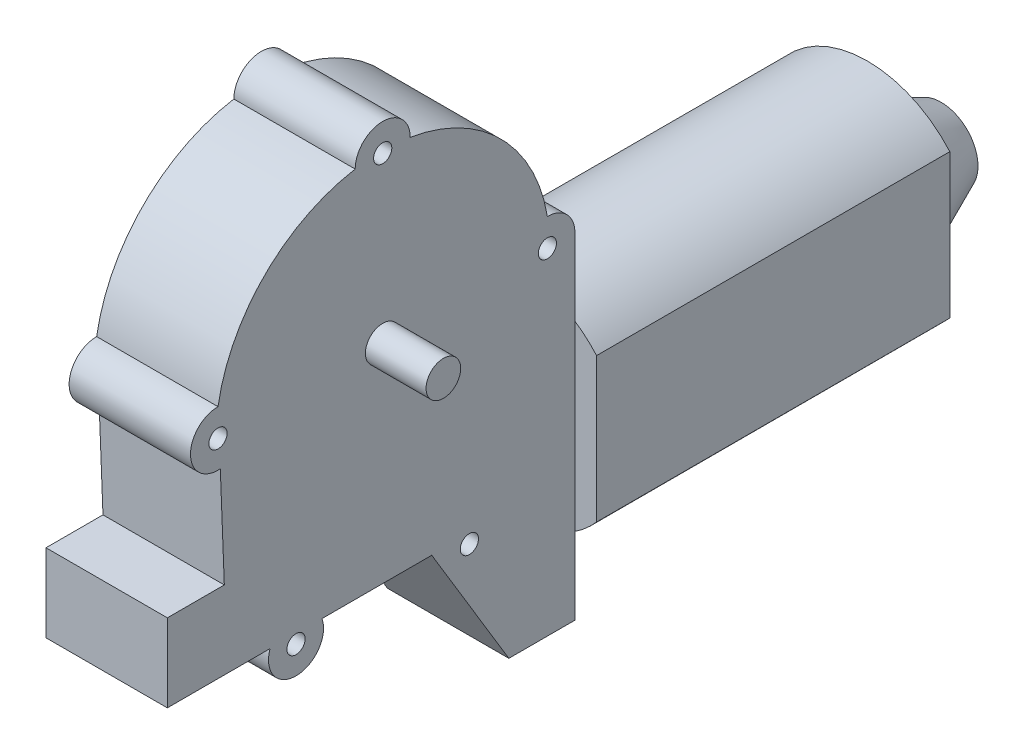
ISO-10303-21;
HEADER;
FILE_DESCRIPTION(('STEP AP214'),'2;1');
FILE_NAME('part.step','',(''),(''),'','','');
FILE_SCHEMA(('AUTOMOTIVE_DESIGN { 1 0 10303 214 1 1 1 1 }'));
ENDSEC;
DATA;
#1=APPLICATION_CONTEXT('core data for automotive mechanical design processes');
#2=APPLICATION_PROTOCOL_DEFINITION('international standard','automotive_design',2000,#1);
#3=PRODUCT_CONTEXT('',#1,'mechanical');
#4=PRODUCT('Part','Part','',(#3));
#5=PRODUCT_RELATED_PRODUCT_CATEGORY('part','',(#4));
#6=PRODUCT_DEFINITION_FORMATION('','',#4);
#7=PRODUCT_DEFINITION_CONTEXT('part definition',#1,'design');
#8=PRODUCT_DEFINITION('design','',#6,#7);
#9=PRODUCT_DEFINITION_SHAPE('','',#8);
#10=(LENGTH_UNIT() NAMED_UNIT(*) SI_UNIT(.MILLI.,.METRE.));
#11=(NAMED_UNIT(*) PLANE_ANGLE_UNIT() SI_UNIT($,.RADIAN.));
#12=(NAMED_UNIT(*) SI_UNIT($,.STERADIAN.) SOLID_ANGLE_UNIT());
#13=UNCERTAINTY_MEASURE_WITH_UNIT(LENGTH_MEASURE(1.E-05),#10,'distance_accuracy_value','');
#14=(GEOMETRIC_REPRESENTATION_CONTEXT(3) GLOBAL_UNCERTAINTY_ASSIGNED_CONTEXT((#13)) GLOBAL_UNIT_ASSIGNED_CONTEXT((#10,
#11,#12)) REPRESENTATION_CONTEXT('',''));
#15=CARTESIAN_POINT('',(0.,0.,0.));
#16=DIRECTION('',(0.,0.,1.));
#17=DIRECTION('',(1.,0.,0.));
#18=AXIS2_PLACEMENT_3D('',#15,#16,#17);
#19=CARTESIAN_POINT('',(-19.,0.,-125.85));
#20=DIRECTION('',(0.,0.,1.));
#21=DIRECTION('',(1.,0.,0.));
#22=AXIS2_PLACEMENT_3D('',#19,#20,#21);
#23=PLANE('',#22);
#24=CARTESIAN_POINT('',(0.,-38.75,-125.85));
#25=DIRECTION('',(0.,0.,-1.));
#26=DIRECTION('',(-1.,0.,0.));
#27=AXIS2_PLACEMENT_3D('',#24,#25,#26);
#28=CIRCLE('',#27,25.25);
#29=CARTESIAN_POINT('',(-19.,-22.1198316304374,-125.85));
#30=VERTEX_POINT('',#29);
#31=CARTESIAN_POINT('',(19.,-22.1198316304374,-125.85));
#32=VERTEX_POINT('',#31);
#33=EDGE_CURVE('E895',#30,#32,#28,.T.);
#34=ORIENTED_EDGE('',*,*,#33,.T.);
#35=DIRECTION('',(0.,-1.,0.));
#36=VECTOR('',#35,1.);
#37=CARTESIAN_POINT('',(19.,0.,-125.85));
#38=LINE('',#37,#36);
#39=CARTESIAN_POINT('',(19.,-55.3801683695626,-125.85));
#40=VERTEX_POINT('',#39);
#41=EDGE_CURVE('E902',#32,#40,#38,.T.);
#42=ORIENTED_EDGE('',*,*,#41,.T.);
#43=CARTESIAN_POINT('',(-19.,-55.3801683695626,-125.85));
#44=VERTEX_POINT('',#43);
#45=EDGE_CURVE('E154',#40,#44,#28,.T.);
#46=ORIENTED_EDGE('',*,*,#45,.T.);
#47=DIRECTION('',(0.,-1.,0.));
#48=VECTOR('',#47,1.);
#49=CARTESIAN_POINT('',(-19.,0.,-125.85));
#50=LINE('',#49,#48);
#51=EDGE_CURVE('E312',#30,#44,#50,.T.);
#52=ORIENTED_EDGE('',*,*,#51,.F.);
#53=EDGE_LOOP('',(#34,#42,#46,#52));
#54=FACE_BOUND('',#53,.T.);
#55=CARTESIAN_POINT('',(0.,-38.75,-125.85));
#56=DIRECTION('',(0.,0.,1.));
#57=DIRECTION('',(1.,0.,0.));
#58=AXIS2_PLACEMENT_3D('',#55,#56,#57);
#59=CIRCLE('',#58,13.85);
#60=CARTESIAN_POINT('',(13.85,-38.75,-125.85));
#61=VERTEX_POINT('',#60);
#62=EDGE_CURVE('E447',#61,#61,#59,.F.);
#63=ORIENTED_EDGE('',*,*,#62,.F.);
#64=EDGE_LOOP('',(#63));
#65=FACE_BOUND('',#64,.T.);
#66=ADVANCED_FACE('F131',(#54,#65),#23,.F.);
#67=CARTESIAN_POINT('',(-19.,0.,-44.35));
#68=DIRECTION('',(0.,0.,1.));
#69=DIRECTION('',(0.,-1.,0.));
#70=AXIS2_PLACEMENT_3D('',#67,#68,#69);
#71=PLANE('',#70);
#72=DIRECTION('',(0.,-1.,0.));
#73=VECTOR('',#72,1.);
#74=CARTESIAN_POINT('',(-14.,0.,-44.35));
#75=LINE('',#74,#73);
#76=CARTESIAN_POINT('',(-14.,-17.7366114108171,-44.35));
#77=VERTEX_POINT('',#76);
#78=CARTESIAN_POINT('',(-14.,-59.7633885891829,-44.35));
#79=VERTEX_POINT('',#78);
#80=EDGE_CURVE('E297',#77,#79,#75,.T.);
#81=ORIENTED_EDGE('',*,*,#80,.F.);
#82=CARTESIAN_POINT('',(0.,-38.75,-44.35));
#83=DIRECTION('',(0.,0.,1.));
#84=DIRECTION('',(0.,-1.,0.));
#85=AXIS2_PLACEMENT_3D('',#82,#83,#84);
#86=CIRCLE('',#85,25.25);
#87=CARTESIAN_POINT('',(-19.,-22.1198316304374,-44.35));
#88=VERTEX_POINT('',#87);
#89=EDGE_CURVE('E300',#88,#77,#86,.F.);
#90=ORIENTED_EDGE('',*,*,#89,.F.);
#91=DIRECTION('',(0.,-1.,0.));
#92=VECTOR('',#91,1.);
#93=CARTESIAN_POINT('',(-19.,0.,-44.35));
#94=LINE('',#93,#92);
#95=CARTESIAN_POINT('',(-19.,-55.3801683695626,-44.35));
#96=VERTEX_POINT('',#95);
#97=EDGE_CURVE('E299',#88,#96,#94,.T.);
#98=ORIENTED_EDGE('',*,*,#97,.T.);
#99=EDGE_CURVE('E285',#79,#96,#86,.F.);
#100=ORIENTED_EDGE('',*,*,#99,.F.);
#101=EDGE_LOOP('',(#81,#90,#98,#100));
#102=FACE_BOUND('',#101,.T.);
#103=ADVANCED_FACE('F295',(#102),#71,.T.);
#104=DIRECTION('',(0.,-1.,0.));
#105=VECTOR('',#104,1.);
#106=CARTESIAN_POINT('',(14.,0.,-44.35));
#107=LINE('',#106,#105);
#108=CARTESIAN_POINT('',(14.,-17.7366114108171,-44.35));
#109=VERTEX_POINT('',#108);
#110=CARTESIAN_POINT('',(14.,-59.7633885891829,-44.35));
#111=VERTEX_POINT('',#110);
#112=EDGE_CURVE('E328',#109,#111,#107,.T.);
#113=ORIENTED_EDGE('',*,*,#112,.T.);
#114=CARTESIAN_POINT('',(19.,-55.3801683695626,-44.35));
#115=VERTEX_POINT('',#114);
#116=EDGE_CURVE('E288',#115,#111,#86,.F.);
#117=ORIENTED_EDGE('',*,*,#116,.F.);
#118=DIRECTION('',(0.,-1.,0.));
#119=VECTOR('',#118,1.);
#120=CARTESIAN_POINT('',(19.,0.,-44.35));
#121=LINE('',#120,#119);
#122=CARTESIAN_POINT('',(19.,-22.1198316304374,-44.35));
#123=VERTEX_POINT('',#122);
#124=EDGE_CURVE('E893',#123,#115,#121,.T.);
#125=ORIENTED_EDGE('',*,*,#124,.F.);
#126=EDGE_CURVE('E146',#109,#123,#86,.F.);
#127=ORIENTED_EDGE('',*,*,#126,.F.);
#128=EDGE_LOOP('',(#113,#117,#125,#127));
#129=FACE_BOUND('',#128,.T.);
#130=ADVANCED_FACE('F471',(#129),#71,.T.);
#131=CARTESIAN_POINT('',(-19.,0.,0.));
#132=DIRECTION('',(1.,0.,0.));
#133=DIRECTION('',(0.,0.,-1.));
#134=AXIS2_PLACEMENT_3D('',#131,#132,#133);
#135=PLANE('',#134);
#136=DIRECTION('',(0.,0.,-1.));
#137=VECTOR('',#136,1.);
#138=CARTESIAN_POINT('',(-19.,-55.3801683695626,88.8692392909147));
#139=LINE('',#138,#137);
#140=EDGE_CURVE('E900',#96,#44,#139,.T.);
#141=ORIENTED_EDGE('',*,*,#140,.F.);
#142=ORIENTED_EDGE('',*,*,#97,.F.);
#143=DIRECTION('',(0.,0.,-1.));
#144=VECTOR('',#143,1.);
#145=CARTESIAN_POINT('',(-19.,-22.1198316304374,88.8692392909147));
#146=LINE('',#145,#144);
#147=EDGE_CURVE('E290',#30,#88,#146,.F.);
#148=ORIENTED_EDGE('',*,*,#147,.F.);
#149=ORIENTED_EDGE('',*,*,#51,.T.);
#150=EDGE_LOOP('',(#141,#142,#148,#149));
#151=FACE_BOUND('',#150,.T.);
#152=ADVANCED_FACE('F697',(#151),#135,.F.);
#153=CARTESIAN_POINT('',(19.,0.,0.));
#154=DIRECTION('',(1.,0.,0.));
#155=DIRECTION('',(0.,0.,-1.));
#156=AXIS2_PLACEMENT_3D('',#153,#154,#155);
#157=PLANE('',#156);
#158=ORIENTED_EDGE('',*,*,#124,.T.);
#159=DIRECTION('',(0.,0.,-1.));
#160=VECTOR('',#159,1.);
#161=CARTESIAN_POINT('',(19.,-55.3801683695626,88.8692392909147));
#162=LINE('',#161,#160);
#163=EDGE_CURVE('E445',#115,#40,#162,.T.);
#164=ORIENTED_EDGE('',*,*,#163,.T.);
#165=ORIENTED_EDGE('',*,*,#41,.F.);
#166=DIRECTION('',(0.,0.,-1.));
#167=VECTOR('',#166,1.);
#168=CARTESIAN_POINT('',(19.,-22.1198316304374,88.8692392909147));
#169=LINE('',#168,#167);
#170=EDGE_CURVE('E419',#32,#123,#169,.F.);
#171=ORIENTED_EDGE('',*,*,#170,.T.);
#172=EDGE_LOOP('',(#158,#164,#165,#171));
#173=FACE_BOUND('',#172,.T.);
#174=ADVANCED_FACE('F547',(#173),#157,.T.);
#175=CARTESIAN_POINT('',(-14.,0.,-44.35));
#176=DIRECTION('',(0.,0.,1.));
#177=DIRECTION('',(0.,-1.,0.));
#178=AXIS2_PLACEMENT_3D('',#175,#176,#177);
#179=PLANE('',#178);
#180=DIRECTION('',(0.,-1.,0.));
#181=VECTOR('',#180,1.);
#182=CARTESIAN_POINT('',(-14.,0.,-44.35));
#183=LINE('',#182,#181);
#184=CARTESIAN_POINT('',(-14.,-77.5,-44.35));
#185=VERTEX_POINT('',#184);
#186=EDGE_CURVE('E269',#79,#185,#183,.T.);
#187=ORIENTED_EDGE('',*,*,#186,.F.);
#188=EDGE_CURVE('E272',#111,#79,#86,.F.);
#189=ORIENTED_EDGE('',*,*,#188,.F.);
#190=CARTESIAN_POINT('',(14.,-77.5,-44.35));
#191=VERTEX_POINT('',#190);
#192=EDGE_CURVE('E324',#111,#191,#107,.T.);
#193=ORIENTED_EDGE('',*,*,#192,.T.);
#194=DIRECTION('',(1.,0.,0.));
#195=VECTOR('',#194,1.);
#196=CARTESIAN_POINT('',(-14.,-77.5,-44.35));
#197=LINE('',#196,#195);
#198=EDGE_CURVE('E275',#185,#191,#197,.T.);
#199=ORIENTED_EDGE('',*,*,#198,.F.);
#200=EDGE_LOOP('',(#187,#189,#193,#199));
#201=FACE_BOUND('',#200,.T.);
#202=ADVANCED_FACE('F271',(#201),#179,.F.);
#203=CARTESIAN_POINT('',(14.,0.,-44.35));
#204=VERTEX_POINT('',#203);
#205=EDGE_CURVE('E325',#204,#109,#107,.T.);
#206=ORIENTED_EDGE('',*,*,#205,.T.);
#207=EDGE_CURVE('E894',#77,#109,#86,.F.);
#208=ORIENTED_EDGE('',*,*,#207,.F.);
#209=CARTESIAN_POINT('',(-14.,0.,-44.35));
#210=VERTEX_POINT('',#209);
#211=EDGE_CURVE('E279',#210,#77,#183,.T.);
#212=ORIENTED_EDGE('',*,*,#211,.F.);
#213=DIRECTION('',(1.,0.,0.));
#214=VECTOR('',#213,1.);
#215=CARTESIAN_POINT('',(-14.,0.,-44.35));
#216=LINE('',#215,#214);
#217=EDGE_CURVE('E440',#210,#204,#216,.T.);
#218=ORIENTED_EDGE('',*,*,#217,.T.);
#219=EDGE_LOOP('',(#206,#208,#212,#218));
#220=FACE_BOUND('',#219,.T.);
#221=ADVANCED_FACE('F546',(#220),#179,.F.);
#222=CARTESIAN_POINT('',(-14.,-7.79596933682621,12.9273018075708));
#223=DIRECTION('',(0.,0.516422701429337,-0.856333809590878));
#224=DIRECTION('',(0.,0.856333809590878,0.516422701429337));
#225=AXIS2_PLACEMENT_3D('',#222,#223,#224);
#226=PLANE('',#225);
#227=DIRECTION('',(1.,0.,0.));
#228=VECTOR('',#227,1.);
#229=CARTESIAN_POINT('',(-14.,-77.5,-29.1085765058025));
#230=LINE('',#229,#228);
#231=CARTESIAN_POINT('',(-14.,-77.5,-29.1085765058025));
#232=VERTEX_POINT('',#231);
#233=CARTESIAN_POINT('',(14.,-77.5,-29.1085765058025));
#234=VERTEX_POINT('',#233);
#235=EDGE_CURVE('E416',#232,#234,#230,.T.);
#236=ORIENTED_EDGE('',*,*,#235,.T.);
#237=DIRECTION('',(0.,0.856333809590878,0.516422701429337));
#238=VECTOR('',#237,1.);
#239=CARTESIAN_POINT('',(14.,-7.79596933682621,12.9273018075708));
#240=LINE('',#239,#238);
#241=CARTESIAN_POINT('',(14.,-48.,-11.3182364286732));
#242=VERTEX_POINT('',#241);
#243=EDGE_CURVE('E318',#234,#242,#240,.T.);
#244=ORIENTED_EDGE('',*,*,#243,.T.);
#245=DIRECTION('',(1.,0.,0.));
#246=VECTOR('',#245,1.);
#247=CARTESIAN_POINT('',(-14.,-48.,-11.3182364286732));
#248=LINE('',#247,#246);
#249=CARTESIAN_POINT('',(-14.,-48.,-11.3182364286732));
#250=VERTEX_POINT('',#249);
#251=EDGE_CURVE('E417',#250,#242,#248,.T.);
#252=ORIENTED_EDGE('',*,*,#251,.F.);
#253=DIRECTION('',(0.,0.856333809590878,0.516422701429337));
#254=VECTOR('',#253,1.);
#255=CARTESIAN_POINT('',(-14.,-7.79596933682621,12.9273018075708));
#256=LINE('',#255,#254);
#257=EDGE_CURVE('E377',#232,#250,#256,.T.);
#258=ORIENTED_EDGE('',*,*,#257,.F.);
#259=EDGE_LOOP('',(#236,#244,#252,#258));
#260=FACE_BOUND('',#259,.T.);
#261=ADVANCED_FACE('F507',(#260),#226,.F.);
#262=CARTESIAN_POINT('',(-14.,-48.,0.));
#263=DIRECTION('',(0.,1.,0.));
#264=DIRECTION('',(0.,0.,1.));
#265=AXIS2_PLACEMENT_3D('',#262,#263,#264);
#266=PLANE('',#265);
#267=ORIENTED_EDGE('',*,*,#251,.T.);
#268=DIRECTION('',(0.,0.,1.));
#269=VECTOR('',#268,1.);
#270=CARTESIAN_POINT('',(14.,-48.,0.));
#271=LINE('',#270,#269);
#272=CARTESIAN_POINT('',(14.,-48.,14.0072961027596));
#273=VERTEX_POINT('',#272);
#274=EDGE_CURVE('E356',#242,#273,#271,.T.);
#275=ORIENTED_EDGE('',*,*,#274,.T.);
#276=DIRECTION('',(1.,0.,0.));
#277=VECTOR('',#276,1.);
#278=CARTESIAN_POINT('',(-14.,-48.,14.0072961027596));
#279=LINE('',#278,#277);
#280=CARTESIAN_POINT('',(-14.,-48.,14.0072961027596));
#281=VERTEX_POINT('',#280);
#282=EDGE_CURVE('E420',#281,#273,#279,.T.);
#283=ORIENTED_EDGE('',*,*,#282,.F.);
#284=DIRECTION('',(0.,0.,1.));
#285=VECTOR('',#284,1.);
#286=CARTESIAN_POINT('',(-14.,-48.,0.));
#287=LINE('',#286,#285);
#288=EDGE_CURVE('E404',#250,#281,#287,.T.);
#289=ORIENTED_EDGE('',*,*,#288,.F.);
#290=EDGE_LOOP('',(#267,#275,#283,#289));
#291=FACE_BOUND('',#290,.T.);
#292=ADVANCED_FACE('F503',(#291),#266,.F.);
#293=CARTESIAN_POINT('',(-14.,-50.1,20.));
#294=DIRECTION('',(1.,0.,0.));
#295=DIRECTION('',(0.,0.,-1.));
#296=AXIS2_PLACEMENT_3D('',#293,#294,#295);
#297=CYLINDRICAL_SURFACE('',#296,6.35);
#298=ORIENTED_EDGE('',*,*,#282,.T.);
#299=CARTESIAN_POINT('',(14.,-50.1,20.));
#300=DIRECTION('',(1.,0.,0.));
#301=DIRECTION('',(0.,0.,-1.));
#302=AXIS2_PLACEMENT_3D('',#299,#300,#301);
#303=CIRCLE('',#302,6.35);
#304=CARTESIAN_POINT('',(14.,-48.,25.9927038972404));
#305=VERTEX_POINT('',#304);
#306=EDGE_CURVE('E355',#305,#273,#303,.T.);
#307=ORIENTED_EDGE('',*,*,#306,.F.);
#308=DIRECTION('',(1.,0.,0.));
#309=VECTOR('',#308,1.);
#310=CARTESIAN_POINT('',(-14.,-48.,25.9927038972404));
#311=LINE('',#310,#309);
#312=CARTESIAN_POINT('',(-14.,-48.,25.9927038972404));
#313=VERTEX_POINT('',#312);
#314=EDGE_CURVE('E422',#313,#305,#311,.T.);
#315=ORIENTED_EDGE('',*,*,#314,.F.);
#316=CARTESIAN_POINT('',(-14.,-50.1,20.));
#317=DIRECTION('',(1.,0.,0.));
#318=DIRECTION('',(0.,0.,-1.));
#319=AXIS2_PLACEMENT_3D('',#316,#317,#318);
#320=CIRCLE('',#319,6.35);
#321=EDGE_CURVE('E403',#313,#281,#320,.T.);
#322=ORIENTED_EDGE('',*,*,#321,.T.);
#323=EDGE_LOOP('',(#298,#307,#315,#322));
#324=FACE_BOUND('',#323,.T.);
#325=ADVANCED_FACE('F506',(#324),#297,.T.);
#326=ORIENTED_EDGE('',*,*,#314,.T.);
#327=CARTESIAN_POINT('',(14.,-48.,49.6890845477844));
#328=VERTEX_POINT('',#327);
#329=EDGE_CURVE('E352',#305,#328,#271,.T.);
#330=ORIENTED_EDGE('',*,*,#329,.T.);
#331=DIRECTION('',(1.,0.,0.));
#332=VECTOR('',#331,1.);
#333=CARTESIAN_POINT('',(-14.,-48.,49.6890845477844));
#334=LINE('',#333,#332);
#335=CARTESIAN_POINT('',(-14.,-48.,49.6890845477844));
#336=VERTEX_POINT('',#335);
#337=EDGE_CURVE('E424',#336,#328,#334,.T.);
#338=ORIENTED_EDGE('',*,*,#337,.F.);
#339=EDGE_CURVE('E401',#313,#336,#287,.T.);
#340=ORIENTED_EDGE('',*,*,#339,.F.);
#341=EDGE_LOOP('',(#326,#330,#338,#340));
#342=FACE_BOUND('',#341,.T.);
#343=ADVANCED_FACE('F509',(#342),#266,.F.);
#344=CARTESIAN_POINT('',(-14.,0.,49.6890845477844));
#345=DIRECTION('',(0.,0.,-1.));
#346=DIRECTION('',(-1.,0.,0.));
#347=AXIS2_PLACEMENT_3D('',#344,#345,#346);
#348=PLANE('',#347);
#349=ORIENTED_EDGE('',*,*,#337,.T.);
#350=DIRECTION('',(0.,1.,0.));
#351=VECTOR('',#350,1.);
#352=CARTESIAN_POINT('',(14.,0.,49.6890845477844));
#353=LINE('',#352,#351);
#354=CARTESIAN_POINT('',(14.,-30.,49.6890845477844));
#355=VERTEX_POINT('',#354);
#356=EDGE_CURVE('E349',#328,#355,#353,.T.);
#357=ORIENTED_EDGE('',*,*,#356,.T.);
#358=DIRECTION('',(1.,0.,0.));
#359=VECTOR('',#358,1.);
#360=CARTESIAN_POINT('',(-14.,-30.,49.6890845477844));
#361=LINE('',#360,#359);
#362=CARTESIAN_POINT('',(-14.,-30.,49.6890845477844));
#363=VERTEX_POINT('',#362);
#364=EDGE_CURVE('E426',#363,#355,#361,.T.);
#365=ORIENTED_EDGE('',*,*,#364,.F.);
#366=DIRECTION('',(0.,1.,0.));
#367=VECTOR('',#366,1.);
#368=CARTESIAN_POINT('',(-14.,0.,49.6890845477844));
#369=LINE('',#368,#367);
#370=EDGE_CURVE('E399',#336,#363,#369,.T.);
#371=ORIENTED_EDGE('',*,*,#370,.F.);
#372=EDGE_LOOP('',(#349,#357,#365,#371));
#373=FACE_BOUND('',#372,.T.);
#374=ADVANCED_FACE('F513',(#373),#348,.F.);
#375=CARTESIAN_POINT('',(-14.,-30.,0.));
#376=DIRECTION('',(0.,-1.,0.));
#377=DIRECTION('',(0.,0.,-1.));
#378=AXIS2_PLACEMENT_3D('',#375,#376,#377);
#379=PLANE('',#378);
#380=ORIENTED_EDGE('',*,*,#364,.T.);
#381=DIRECTION('',(0.,0.,-1.));
#382=VECTOR('',#381,1.);
#383=CARTESIAN_POINT('',(14.,-30.,0.));
#384=LINE('',#383,#382);
#385=CARTESIAN_POINT('',(14.,-30.,36.5448778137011));
#386=VERTEX_POINT('',#385);
#387=EDGE_CURVE('E346',#355,#386,#384,.T.);
#388=ORIENTED_EDGE('',*,*,#387,.T.);
#389=DIRECTION('',(1.,0.,0.));
#390=VECTOR('',#389,1.);
#391=CARTESIAN_POINT('',(-14.,-30.,36.5448778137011));
#392=LINE('',#391,#390);
#393=CARTESIAN_POINT('',(-14.,-30.,36.5448778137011));
#394=VERTEX_POINT('',#393);
#395=EDGE_CURVE('E428',#394,#386,#392,.T.);
#396=ORIENTED_EDGE('',*,*,#395,.F.);
#397=DIRECTION('',(0.,0.,-1.));
#398=VECTOR('',#397,1.);
#399=CARTESIAN_POINT('',(-14.,-30.,0.));
#400=LINE('',#399,#398);
#401=EDGE_CURVE('E397',#363,#394,#400,.T.);
#402=ORIENTED_EDGE('',*,*,#401,.F.);
#403=EDGE_LOOP('',(#380,#388,#396,#402));
#404=FACE_BOUND('',#403,.T.);
#405=ADVANCED_FACE('F516',(#404),#379,.F.);
#406=CARTESIAN_POINT('',(-14.,-1.47084932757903,37.6591381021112));
#407=DIRECTION('',(0.,0.0390271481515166,-0.999238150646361));
#408=DIRECTION('',(0.,0.999238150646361,0.0390271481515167));
#409=AXIS2_PLACEMENT_3D('',#406,#407,#408);
#410=PLANE('',#409);
#411=ORIENTED_EDGE('',*,*,#395,.T.);
#412=DIRECTION('',(0.,0.999238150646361,0.0390271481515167));
#413=VECTOR('',#412,1.);
#414=CARTESIAN_POINT('',(14.,-1.47084932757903,37.6591381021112));
#415=LINE('',#414,#413);
#416=CARTESIAN_POINT('',(14.,-6.32779637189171,37.4694407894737));
#417=VERTEX_POINT('',#416);
#418=EDGE_CURVE('E343',#386,#417,#415,.T.);
#419=ORIENTED_EDGE('',*,*,#418,.T.);
#420=DIRECTION('',(1.,0.,0.));
#421=VECTOR('',#420,1.);
#422=CARTESIAN_POINT('',(-14.,-6.32779637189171,37.4694407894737));
#423=LINE('',#422,#421);
#424=CARTESIAN_POINT('',(-14.,-6.32779637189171,37.4694407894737));
#425=VERTEX_POINT('',#424);
#426=EDGE_CURVE('E430',#425,#417,#423,.T.);
#427=ORIENTED_EDGE('',*,*,#426,.F.);
#428=DIRECTION('',(0.,0.999238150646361,0.0390271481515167));
#429=VECTOR('',#428,1.);
#430=CARTESIAN_POINT('',(-14.,-1.47084932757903,37.6591381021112));
#431=LINE('',#430,#429);
#432=EDGE_CURVE('E395',#394,#425,#431,.T.);
#433=ORIENTED_EDGE('',*,*,#432,.F.);
#434=EDGE_LOOP('',(#411,#419,#427,#433));
#435=FACE_BOUND('',#434,.T.);
#436=ADVANCED_FACE('F520',(#435),#410,.F.);
#437=CARTESIAN_POINT('',(-14.,0.,38.));
#438=DIRECTION('',(1.,0.,0.));
#439=DIRECTION('',(0.,0.,-1.));
#440=AXIS2_PLACEMENT_3D('',#437,#438,#439);
#441=CYLINDRICAL_SURFACE('',#440,6.35);
#442=ORIENTED_EDGE('',*,*,#426,.T.);
#443=CARTESIAN_POINT('',(14.,0.,38.));
#444=DIRECTION('',(1.,0.,0.));
#445=DIRECTION('',(0.,0.,-1.));
#446=AXIS2_PLACEMENT_3D('',#443,#444,#445);
#447=CIRCLE('',#446,6.35);
#448=CARTESIAN_POINT('',(14.,6.35,38.));
#449=VERTEX_POINT('',#448);
#450=EDGE_CURVE('E340',#449,#417,#447,.T.);
#451=ORIENTED_EDGE('',*,*,#450,.F.);
#452=DIRECTION('',(1.,0.,0.));
#453=VECTOR('',#452,1.);
#454=CARTESIAN_POINT('',(-14.,6.35,38.));
#455=LINE('',#454,#453);
#456=CARTESIAN_POINT('',(-14.,6.35,38.));
#457=VERTEX_POINT('',#456);
#458=EDGE_CURVE('E432',#457,#449,#455,.T.);
#459=ORIENTED_EDGE('',*,*,#458,.F.);
#460=CARTESIAN_POINT('',(-14.,0.,38.));
#461=DIRECTION('',(1.,0.,0.));
#462=DIRECTION('',(0.,0.,-1.));
#463=AXIS2_PLACEMENT_3D('',#460,#461,#462);
#464=CIRCLE('',#463,6.35);
#465=EDGE_CURVE('E392',#457,#425,#464,.T.);
#466=ORIENTED_EDGE('',*,*,#465,.T.);
#467=EDGE_LOOP('',(#442,#451,#459,#466));
#468=FACE_BOUND('',#467,.T.);
#469=ADVANCED_FACE('F524',(#468),#441,.T.);
#470=CARTESIAN_POINT('',(-14.,0.,0.));
#471=DIRECTION('',(1.,0.,0.));
#472=DIRECTION('',(0.,0.,-1.));
#473=AXIS2_PLACEMENT_3D('',#470,#471,#472);
#474=CYLINDRICAL_SURFACE('',#473,38.5269061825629);
#475=ORIENTED_EDGE('',*,*,#458,.T.);
#476=CARTESIAN_POINT('',(14.,0.,0.));
#477=DIRECTION('',(1.,0.,0.));
#478=DIRECTION('',(0.,0.,-1.));
#479=AXIS2_PLACEMENT_3D('',#476,#477,#478);
#480=CIRCLE('',#479,38.5269061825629);
#481=CARTESIAN_POINT('',(14.,38.,6.35));
#482=VERTEX_POINT('',#481);
#483=EDGE_CURVE('E337',#482,#449,#480,.T.);
#484=ORIENTED_EDGE('',*,*,#483,.F.);
#485=DIRECTION('',(1.,0.,0.));
#486=VECTOR('',#485,1.);
#487=CARTESIAN_POINT('',(-14.,38.,6.35));
#488=LINE('',#487,#486);
#489=CARTESIAN_POINT('',(-14.,38.,6.35));
#490=VERTEX_POINT('',#489);
#491=EDGE_CURVE('E434',#490,#482,#488,.T.);
#492=ORIENTED_EDGE('',*,*,#491,.F.);
#493=CARTESIAN_POINT('',(-14.,0.,0.));
#494=DIRECTION('',(1.,0.,0.));
#495=DIRECTION('',(0.,0.,-1.));
#496=AXIS2_PLACEMENT_3D('',#493,#494,#495);
#497=CIRCLE('',#496,38.5269061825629);
#498=EDGE_CURVE('E389',#490,#457,#497,.T.);
#499=ORIENTED_EDGE('',*,*,#498,.T.);
#500=EDGE_LOOP('',(#475,#484,#492,#499));
#501=FACE_BOUND('',#500,.T.);
#502=ADVANCED_FACE('F528',(#501),#474,.T.);
#503=CARTESIAN_POINT('',(-14.,38.,0.));
#504=DIRECTION('',(1.,0.,0.));
#505=DIRECTION('',(0.,0.,-1.));
#506=AXIS2_PLACEMENT_3D('',#503,#504,#505);
#507=CYLINDRICAL_SURFACE('',#506,6.35);
#508=ORIENTED_EDGE('',*,*,#491,.T.);
#509=CARTESIAN_POINT('',(14.,38.,0.));
#510=DIRECTION('',(1.,0.,0.));
#511=DIRECTION('',(0.,0.,-1.));
#512=AXIS2_PLACEMENT_3D('',#509,#510,#511);
#513=CIRCLE('',#512,6.35);
#514=CARTESIAN_POINT('',(14.,38.,-6.35));
#515=VERTEX_POINT('',#514);
#516=EDGE_CURVE('E334',#515,#482,#513,.T.);
#517=ORIENTED_EDGE('',*,*,#516,.F.);
#518=DIRECTION('',(1.,0.,0.));
#519=VECTOR('',#518,1.);
#520=CARTESIAN_POINT('',(-14.,38.,-6.35));
#521=LINE('',#520,#519);
#522=CARTESIAN_POINT('',(-14.,38.,-6.35));
#523=VERTEX_POINT('',#522);
#524=EDGE_CURVE('E436',#523,#515,#521,.T.);
#525=ORIENTED_EDGE('',*,*,#524,.F.);
#526=CARTESIAN_POINT('',(-14.,38.,0.));
#527=DIRECTION('',(1.,0.,0.));
#528=DIRECTION('',(0.,0.,-1.));
#529=AXIS2_PLACEMENT_3D('',#526,#527,#528);
#530=CIRCLE('',#529,6.35);
#531=EDGE_CURVE('E386',#523,#490,#530,.T.);
#532=ORIENTED_EDGE('',*,*,#531,.T.);
#533=EDGE_LOOP('',(#508,#517,#525,#532));
#534=FACE_BOUND('',#533,.T.);
#535=ADVANCED_FACE('F532',(#534),#507,.T.);
#536=CARTESIAN_POINT('',(-14.,0.,0.));
#537=DIRECTION('',(1.,0.,0.));
#538=DIRECTION('',(0.,0.,-1.));
#539=AXIS2_PLACEMENT_3D('',#536,#537,#538);
#540=CYLINDRICAL_SURFACE('',#539,38.5269061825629);
#541=ORIENTED_EDGE('',*,*,#524,.T.);
#542=CARTESIAN_POINT('',(14.,0.,0.));
#543=DIRECTION('',(1.,0.,0.));
#544=DIRECTION('',(0.,0.,-1.));
#545=AXIS2_PLACEMENT_3D('',#542,#543,#544);
#546=CIRCLE('',#545,38.5269061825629);
#547=CARTESIAN_POINT('',(14.,6.35,-38.));
#548=VERTEX_POINT('',#547);
#549=EDGE_CURVE('E331',#548,#515,#546,.T.);
#550=ORIENTED_EDGE('',*,*,#549,.F.);
#551=DIRECTION('',(1.,0.,0.));
#552=VECTOR('',#551,1.);
#553=CARTESIAN_POINT('',(-14.,6.35,-38.));
#554=LINE('',#553,#552);
#555=CARTESIAN_POINT('',(-14.,6.35,-38.));
#556=VERTEX_POINT('',#555);
#557=EDGE_CURVE('E438',#556,#548,#554,.T.);
#558=ORIENTED_EDGE('',*,*,#557,.F.);
#559=CARTESIAN_POINT('',(-14.,0.,0.));
#560=DIRECTION('',(1.,0.,0.));
#561=DIRECTION('',(0.,0.,-1.));
#562=AXIS2_PLACEMENT_3D('',#559,#560,#561);
#563=CIRCLE('',#562,38.5269061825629);
#564=EDGE_CURVE('E383',#556,#523,#563,.T.);
#565=ORIENTED_EDGE('',*,*,#564,.T.);
#566=EDGE_LOOP('',(#541,#550,#558,#565));
#567=FACE_BOUND('',#566,.T.);
#568=ADVANCED_FACE('F536',(#567),#540,.T.);
#569=CARTESIAN_POINT('',(-14.,0.,-38.));
#570=DIRECTION('',(1.,0.,0.));
#571=DIRECTION('',(0.,0.,-1.));
#572=AXIS2_PLACEMENT_3D('',#569,#570,#571);
#573=CYLINDRICAL_SURFACE('',#572,6.35);
#574=ORIENTED_EDGE('',*,*,#557,.T.);
#575=CARTESIAN_POINT('',(14.,0.,-38.));
#576=DIRECTION('',(1.,0.,0.));
#577=DIRECTION('',(0.,0.,-1.));
#578=AXIS2_PLACEMENT_3D('',#575,#576,#577);
#579=CIRCLE('',#578,6.35);
#580=EDGE_CURVE('E327',#204,#548,#579,.T.);
#581=ORIENTED_EDGE('',*,*,#580,.F.);
#582=ORIENTED_EDGE('',*,*,#217,.F.);
#583=CARTESIAN_POINT('',(-14.,0.,-38.));
#584=DIRECTION('',(1.,0.,0.));
#585=DIRECTION('',(0.,0.,-1.));
#586=AXIS2_PLACEMENT_3D('',#583,#584,#585);
#587=CIRCLE('',#586,6.35);
#588=EDGE_CURVE('E380',#210,#556,#587,.T.);
#589=ORIENTED_EDGE('',*,*,#588,.T.);
#590=EDGE_LOOP('',(#574,#581,#582,#589));
#591=FACE_BOUND('',#590,.T.);
#592=ADVANCED_FACE('F497',(#591),#573,.T.);
#593=CARTESIAN_POINT('',(-14.,38.,0.));
#594=DIRECTION('',(1.,0.,0.));
#595=DIRECTION('',(0.,0.,-1.));
#596=AXIS2_PLACEMENT_3D('',#593,#594,#595);
#597=CYLINDRICAL_SURFACE('',#596,2.1);
#598=CARTESIAN_POINT('',(-14.,38.,0.));
#599=DIRECTION('',(1.,0.,0.));
#600=DIRECTION('',(0.,0.,-1.));
#601=AXIS2_PLACEMENT_3D('',#598,#599,#600);
#602=CIRCLE('',#601,2.1);
#603=CARTESIAN_POINT('',(-14.,38.,-2.1));
#604=VERTEX_POINT('',#603);
#605=EDGE_CURVE('E410',#604,#604,#602,.T.);
#606=ORIENTED_EDGE('',*,*,#605,.F.);
#607=EDGE_LOOP('',(#606));
#608=FACE_BOUND('',#607,.T.);
#609=CARTESIAN_POINT('',(14.,38.,0.));
#610=DIRECTION('',(1.,0.,0.));
#611=DIRECTION('',(0.,0.,-1.));
#612=AXIS2_PLACEMENT_3D('',#609,#610,#611);
#613=CIRCLE('',#612,2.1);
#614=CARTESIAN_POINT('',(14.,38.,-2.1));
#615=VERTEX_POINT('',#614);
#616=EDGE_CURVE('E365',#615,#615,#613,.T.);
#617=ORIENTED_EDGE('',*,*,#616,.T.);
#618=EDGE_LOOP('',(#617));
#619=FACE_BOUND('',#618,.T.);
#620=ADVANCED_FACE('F493',(#608,#619),#597,.F.);
#621=CARTESIAN_POINT('',(-14.,0.,38.));
#622=DIRECTION('',(1.,0.,0.));
#623=DIRECTION('',(0.,0.,-1.));
#624=AXIS2_PLACEMENT_3D('',#621,#622,#623);
#625=CYLINDRICAL_SURFACE('',#624,2.1);
#626=CARTESIAN_POINT('',(-14.,0.,38.));
#627=DIRECTION('',(1.,0.,0.));
#628=DIRECTION('',(0.,0.,-1.));
#629=AXIS2_PLACEMENT_3D('',#626,#627,#628);
#630=CIRCLE('',#629,2.1);
#631=CARTESIAN_POINT('',(-14.,0.,35.9));
#632=VERTEX_POINT('',#631);
#633=EDGE_CURVE('E407',#632,#632,#630,.T.);
#634=ORIENTED_EDGE('',*,*,#633,.F.);
#635=EDGE_LOOP('',(#634));
#636=FACE_BOUND('',#635,.T.);
#637=CARTESIAN_POINT('',(14.,0.,38.));
#638=DIRECTION('',(1.,0.,0.));
#639=DIRECTION('',(0.,0.,-1.));
#640=AXIS2_PLACEMENT_3D('',#637,#638,#639);
#641=CIRCLE('',#640,2.1);
#642=CARTESIAN_POINT('',(14.,0.,35.9));
#643=VERTEX_POINT('',#642);
#644=EDGE_CURVE('E362',#643,#643,#641,.T.);
#645=ORIENTED_EDGE('',*,*,#644,.T.);
#646=EDGE_LOOP('',(#645));
#647=FACE_BOUND('',#646,.T.);
#648=ADVANCED_FACE('F496',(#636,#647),#625,.F.);
#649=CARTESIAN_POINT('',(-14.,-77.5,0.));
#650=DIRECTION('',(0.,1.,0.));
#651=DIRECTION('',(0.,0.,1.));
#652=AXIS2_PLACEMENT_3D('',#649,#650,#651);
#653=PLANE('',#652);
#654=ORIENTED_EDGE('',*,*,#198,.T.);
#655=DIRECTION('',(0.,0.,1.));
#656=VECTOR('',#655,1.);
#657=CARTESIAN_POINT('',(14.,-77.5,0.));
#658=LINE('',#657,#656);
#659=EDGE_CURVE('E321',#191,#234,#658,.T.);
#660=ORIENTED_EDGE('',*,*,#659,.T.);
#661=ORIENTED_EDGE('',*,*,#235,.F.);
#662=DIRECTION('',(0.,0.,1.));
#663=VECTOR('',#662,1.);
#664=CARTESIAN_POINT('',(-14.,-77.5,0.));
#665=LINE('',#664,#663);
#666=EDGE_CURVE('E280',#185,#232,#665,.T.);
#667=ORIENTED_EDGE('',*,*,#666,.F.);
#668=EDGE_LOOP('',(#654,#660,#661,#667));
#669=FACE_BOUND('',#668,.T.);
#670=ADVANCED_FACE('F501',(#669),#653,.F.);
#671=CARTESIAN_POINT('',(-14.,-50.1,20.));
#672=DIRECTION('',(1.,0.,0.));
#673=DIRECTION('',(0.,0.,-1.));
#674=AXIS2_PLACEMENT_3D('',#671,#672,#673);
#675=CYLINDRICAL_SURFACE('',#674,2.1);
#676=CARTESIAN_POINT('',(-14.,-50.1,20.));
#677=DIRECTION('',(1.,0.,0.));
#678=DIRECTION('',(0.,0.,-1.));
#679=AXIS2_PLACEMENT_3D('',#676,#677,#678);
#680=CIRCLE('',#679,2.1);
#681=CARTESIAN_POINT('',(-14.,-50.1,17.9));
#682=VERTEX_POINT('',#681);
#683=EDGE_CURVE('E374',#682,#682,#680,.T.);
#684=ORIENTED_EDGE('',*,*,#683,.F.);
#685=EDGE_LOOP('',(#684));
#686=FACE_BOUND('',#685,.T.);
#687=CARTESIAN_POINT('',(14.,-50.1,20.));
#688=DIRECTION('',(1.,0.,0.));
#689=DIRECTION('',(0.,0.,-1.));
#690=AXIS2_PLACEMENT_3D('',#687,#688,#689);
#691=CIRCLE('',#690,2.1);
#692=CARTESIAN_POINT('',(14.,-50.1,17.9));
#693=VERTEX_POINT('',#692);
#694=EDGE_CURVE('E310',#693,#693,#691,.T.);
#695=ORIENTED_EDGE('',*,*,#694,.T.);
#696=EDGE_LOOP('',(#695));
#697=FACE_BOUND('',#696,.T.);
#698=ADVANCED_FACE('F491',(#686,#697),#675,.F.);
#699=CARTESIAN_POINT('',(-14.,0.,-38.));
#700=DIRECTION('',(1.,0.,0.));
#701=DIRECTION('',(0.,0.,-1.));
#702=AXIS2_PLACEMENT_3D('',#699,#700,#701);
#703=CYLINDRICAL_SURFACE('',#702,2.1);
#704=CARTESIAN_POINT('',(-14.,0.,-38.));
#705=DIRECTION('',(1.,0.,0.));
#706=DIRECTION('',(0.,0.,-1.));
#707=AXIS2_PLACEMENT_3D('',#704,#705,#706);
#708=CIRCLE('',#707,2.1);
#709=CARTESIAN_POINT('',(-14.,0.,-40.1));
#710=VERTEX_POINT('',#709);
#711=EDGE_CURVE('E413',#710,#710,#708,.T.);
#712=ORIENTED_EDGE('',*,*,#711,.F.);
#713=EDGE_LOOP('',(#712));
#714=FACE_BOUND('',#713,.T.);
#715=CARTESIAN_POINT('',(14.,0.,-38.));
#716=DIRECTION('',(1.,0.,0.));
#717=DIRECTION('',(0.,0.,-1.));
#718=AXIS2_PLACEMENT_3D('',#715,#716,#717);
#719=CIRCLE('',#718,2.1);
#720=CARTESIAN_POINT('',(14.,0.,-40.1));
#721=VERTEX_POINT('',#720);
#722=EDGE_CURVE('E368',#721,#721,#719,.T.);
#723=ORIENTED_EDGE('',*,*,#722,.T.);
#724=EDGE_LOOP('',(#723));
#725=FACE_BOUND('',#724,.T.);
#726=ADVANCED_FACE('F487',(#714,#725),#703,.F.);
#727=CARTESIAN_POINT('',(-14.,0.,0.));
#728=DIRECTION('',(1.,0.,0.));
#729=DIRECTION('',(0.,0.,-1.));
#730=AXIS2_PLACEMENT_3D('',#727,#728,#729);
#731=PLANE('',#730);
#732=CARTESIAN_POINT('',(-14.,-50.1,-20.));
#733=DIRECTION('',(1.,0.,0.));
#734=DIRECTION('',(0.,0.,-1.));
#735=AXIS2_PLACEMENT_3D('',#732,#733,#734);
#736=CIRCLE('',#735,2.1);
#737=CARTESIAN_POINT('',(-14.,-50.1,-22.1));
#738=VERTEX_POINT('',#737);
#739=EDGE_CURVE('E371',#738,#738,#736,.T.);
#740=ORIENTED_EDGE('',*,*,#739,.T.);
#741=EDGE_LOOP('',(#740));
#742=FACE_BOUND('',#741,.T.);
#743=ORIENTED_EDGE('',*,*,#683,.T.);
#744=EDGE_LOOP('',(#743));
#745=FACE_BOUND('',#744,.T.);
#746=ORIENTED_EDGE('',*,*,#257,.T.);
#747=ORIENTED_EDGE('',*,*,#288,.T.);
#748=ORIENTED_EDGE('',*,*,#321,.F.);
#749=ORIENTED_EDGE('',*,*,#339,.T.);
#750=ORIENTED_EDGE('',*,*,#370,.T.);
#751=ORIENTED_EDGE('',*,*,#401,.T.);
#752=ORIENTED_EDGE('',*,*,#432,.T.);
#753=ORIENTED_EDGE('',*,*,#465,.F.);
#754=ORIENTED_EDGE('',*,*,#498,.F.);
#755=ORIENTED_EDGE('',*,*,#531,.F.);
#756=ORIENTED_EDGE('',*,*,#564,.F.);
#757=ORIENTED_EDGE('',*,*,#588,.F.);
#758=ORIENTED_EDGE('',*,*,#211,.T.);
#759=ORIENTED_EDGE('',*,*,#80,.T.);
#760=ORIENTED_EDGE('',*,*,#186,.T.);
#761=ORIENTED_EDGE('',*,*,#666,.T.);
#762=EDGE_LOOP('',(#746,#747,#748,#749,#750,#751,#752,#753,#754,#755,#756,#757,#758,#759,#760,#761));
#763=FACE_BOUND('',#762,.T.);
#764=CARTESIAN_POINT('',(-14.,0.,0.));
#765=DIRECTION('',(1.,0.,0.));
#766=DIRECTION('',(0.,0.,-1.));
#767=AXIS2_PLACEMENT_3D('',#764,#765,#766);
#768=CIRCLE('',#767,4.);
#769=CARTESIAN_POINT('',(-14.,0.,-4.));
#770=VERTEX_POINT('',#769);
#771=EDGE_CURVE('E909',#770,#770,#768,.T.);
#772=ORIENTED_EDGE('',*,*,#771,.T.);
#773=EDGE_LOOP('',(#772));
#774=FACE_BOUND('',#773,.T.);
#775=ORIENTED_EDGE('',*,*,#633,.T.);
#776=EDGE_LOOP('',(#775));
#777=FACE_BOUND('',#776,.T.);
#778=ORIENTED_EDGE('',*,*,#605,.T.);
#779=EDGE_LOOP('',(#778));
#780=FACE_BOUND('',#779,.T.);
#781=ORIENTED_EDGE('',*,*,#711,.T.);
#782=EDGE_LOOP('',(#781));
#783=FACE_BOUND('',#782,.T.);
#784=ADVANCED_FACE('F302',(#742,#745,#763,#774,#777,#780,#783),#731,.F.);
#785=CARTESIAN_POINT('',(-14.,-50.1,-20.));
#786=DIRECTION('',(1.,0.,0.));
#787=DIRECTION('',(0.,0.,-1.));
#788=AXIS2_PLACEMENT_3D('',#785,#786,#787);
#789=CYLINDRICAL_SURFACE('',#788,2.1);
#790=ORIENTED_EDGE('',*,*,#739,.F.);
#791=EDGE_LOOP('',(#790));
#792=FACE_BOUND('',#791,.T.);
#793=CARTESIAN_POINT('',(14.,-50.1,-20.));
#794=DIRECTION('',(1.,0.,0.));
#795=DIRECTION('',(0.,0.,-1.));
#796=AXIS2_PLACEMENT_3D('',#793,#794,#795);
#797=CIRCLE('',#796,2.1);
#798=CARTESIAN_POINT('',(14.,-50.1,-22.1));
#799=VERTEX_POINT('',#798);
#800=EDGE_CURVE('E307',#799,#799,#797,.T.);
#801=ORIENTED_EDGE('',*,*,#800,.T.);
#802=EDGE_LOOP('',(#801));
#803=FACE_BOUND('',#802,.T.);
#804=ADVANCED_FACE('F480',(#792,#803),#789,.F.);
#805=CARTESIAN_POINT('',(14.,0.,0.));
#806=DIRECTION('',(1.,0.,0.));
#807=DIRECTION('',(0.,0.,-1.));
#808=AXIS2_PLACEMENT_3D('',#805,#806,#807);
#809=PLANE('',#808);
#810=ORIENTED_EDGE('',*,*,#722,.F.);
#811=EDGE_LOOP('',(#810));
#812=FACE_BOUND('',#811,.T.);
#813=ORIENTED_EDGE('',*,*,#616,.F.);
#814=EDGE_LOOP('',(#813));
#815=FACE_BOUND('',#814,.T.);
#816=ORIENTED_EDGE('',*,*,#644,.F.);
#817=EDGE_LOOP('',(#816));
#818=FACE_BOUND('',#817,.T.);
#819=CARTESIAN_POINT('',(14.,0.,0.));
#820=DIRECTION('',(1.,0.,0.));
#821=DIRECTION('',(0.,0.,-1.));
#822=AXIS2_PLACEMENT_3D('',#819,#820,#821);
#823=CIRCLE('',#822,4.);
#824=CARTESIAN_POINT('',(14.,0.,-4.));
#825=VERTEX_POINT('',#824);
#826=EDGE_CURVE('E359',#825,#825,#823,.T.);
#827=ORIENTED_EDGE('',*,*,#826,.F.);
#828=EDGE_LOOP('',(#827));
#829=FACE_BOUND('',#828,.T.);
#830=ORIENTED_EDGE('',*,*,#243,.F.);
#831=ORIENTED_EDGE('',*,*,#659,.F.);
#832=ORIENTED_EDGE('',*,*,#192,.F.);
#833=ORIENTED_EDGE('',*,*,#112,.F.);
#834=ORIENTED_EDGE('',*,*,#205,.F.);
#835=ORIENTED_EDGE('',*,*,#580,.T.);
#836=ORIENTED_EDGE('',*,*,#549,.T.);
#837=ORIENTED_EDGE('',*,*,#516,.T.);
#838=ORIENTED_EDGE('',*,*,#483,.T.);
#839=ORIENTED_EDGE('',*,*,#450,.T.);
#840=ORIENTED_EDGE('',*,*,#418,.F.);
#841=ORIENTED_EDGE('',*,*,#387,.F.);
#842=ORIENTED_EDGE('',*,*,#356,.F.);
#843=ORIENTED_EDGE('',*,*,#329,.F.);
#844=ORIENTED_EDGE('',*,*,#306,.T.);
#845=ORIENTED_EDGE('',*,*,#274,.F.);
#846=EDGE_LOOP('',(#830,#831,#832,#833,#834,#835,#836,#837,#838,#839,#840,#841,#842,#843,#844,#845));
#847=FACE_BOUND('',#846,.T.);
#848=ORIENTED_EDGE('',*,*,#694,.F.);
#849=EDGE_LOOP('',(#848));
#850=FACE_BOUND('',#849,.T.);
#851=ORIENTED_EDGE('',*,*,#800,.F.);
#852=EDGE_LOOP('',(#851));
#853=FACE_BOUND('',#852,.T.);
#854=ADVANCED_FACE('F476',(#812,#815,#818,#829,#847,#850,#853),#809,.T.);
#855=CARTESIAN_POINT('',(0.,-38.75,88.8692392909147));
#856=DIRECTION('',(0.,0.,-1.));
#857=DIRECTION('',(-1.,0.,0.));
#858=AXIS2_PLACEMENT_3D('',#855,#856,#857);
#859=CYLINDRICAL_SURFACE('',#858,25.25);
#860=ORIENTED_EDGE('',*,*,#207,.T.);
#861=ORIENTED_EDGE('',*,*,#126,.T.);
#862=ORIENTED_EDGE('',*,*,#170,.F.);
#863=ORIENTED_EDGE('',*,*,#33,.F.);
#864=ORIENTED_EDGE('',*,*,#147,.T.);
#865=ORIENTED_EDGE('',*,*,#89,.T.);
#866=EDGE_LOOP('',(#860,#861,#862,#863,#864,#865));
#867=FACE_BOUND('',#866,.T.);
#868=ADVANCED_FACE('F479',(#867),#859,.T.);
#869=ORIENTED_EDGE('',*,*,#116,.T.);
#870=ORIENTED_EDGE('',*,*,#188,.T.);
#871=ORIENTED_EDGE('',*,*,#99,.T.);
#872=ORIENTED_EDGE('',*,*,#140,.T.);
#873=ORIENTED_EDGE('',*,*,#45,.F.);
#874=ORIENTED_EDGE('',*,*,#163,.F.);
#875=EDGE_LOOP('',(#869,#870,#871,#872,#873,#874));
#876=FACE_BOUND('',#875,.T.);
#877=ADVANCED_FACE('F284',(#876),#859,.T.);
#878=CARTESIAN_POINT('',(0.,-38.75,-142.85));
#879=DIRECTION('',(0.,0.,1.));
#880=DIRECTION('',(1.,0.,0.));
#881=AXIS2_PLACEMENT_3D('',#878,#879,#880);
#882=CYLINDRICAL_SURFACE('',#881,13.85);
#883=CARTESIAN_POINT('',(0.,-38.75,-130.85));
#884=DIRECTION('',(0.,0.,-1.));
#885=DIRECTION('',(-1.,0.,0.));
#886=AXIS2_PLACEMENT_3D('',#883,#884,#885);
#887=CIRCLE('',#886,13.85);
#888=CARTESIAN_POINT('',(13.85,-38.75,-130.85));
#889=VERTEX_POINT('',#888);
#890=EDGE_CURVE('E13',#889,#889,#887,.F.);
#891=ORIENTED_EDGE('',*,*,#890,.T.);
#892=EDGE_LOOP('',(#891));
#893=FACE_BOUND('',#892,.T.);
#894=ORIENTED_EDGE('',*,*,#62,.T.);
#895=EDGE_LOOP('',(#894));
#896=FACE_BOUND('',#895,.T.);
#897=ADVANCED_FACE('F463',(#893,#896),#882,.T.);
#898=CARTESIAN_POINT('',(0.,-38.75,-142.85));
#899=DIRECTION('',(0.,0.,-1.));
#900=DIRECTION('',(-1.,0.,0.));
#901=AXIS2_PLACEMENT_3D('',#898,#899,#900);
#902=PLANE('',#901);
#903=CARTESIAN_POINT('',(0.,-38.75,-142.85));
#904=DIRECTION('',(0.,0.,-1.));
#905=DIRECTION('',(-1.,0.,0.));
#906=AXIS2_PLACEMENT_3D('',#903,#904,#905);
#907=CIRCLE('',#906,8.50725577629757);
#908=CARTESIAN_POINT('',(8.50725577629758,-38.75,-142.85));
#909=VERTEX_POINT('',#908);
#910=EDGE_CURVE('E139',#909,#909,#907,.T.);
#911=ORIENTED_EDGE('',*,*,#910,.T.);
#912=EDGE_LOOP('',(#911));
#913=FACE_BOUND('',#912,.T.);
#914=ADVANCED_FACE('F452',(#913),#902,.T.);
#915=CARTESIAN_POINT('',(0.,-38.75,-142.85));
#916=DIRECTION('',(0.,0.,1.));
#917=DIRECTION('',(1.,0.,0.));
#918=AXIS2_PLACEMENT_3D('',#915,#916,#917);
#919=CONICAL_SURFACE('',#918,8.50725577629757,0.418879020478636);
#920=CARTESIAN_POINT('',(13.85,-38.75,-130.85));
#921=CARTESIAN_POINT('',(13.7943464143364,-38.75,-130.975));
#922=CARTESIAN_POINT('',(13.7386928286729,-38.75,-131.1));
#923=CARTESIAN_POINT('',(13.6273856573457,-38.75,-131.35));
#924=CARTESIAN_POINT('',(13.5717320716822,-38.75,-131.475));
#925=CARTESIAN_POINT('',(13.460424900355,-38.75,-131.725));
#926=CARTESIAN_POINT('',(13.4047713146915,-38.75,-131.85));
#927=CARTESIAN_POINT('',(13.2934641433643,-38.75,-132.1));
#928=CARTESIAN_POINT('',(13.2378105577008,-38.75,-132.225));
#929=CARTESIAN_POINT('',(13.1265033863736,-38.75,-132.475));
#930=CARTESIAN_POINT('',(13.0708498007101,-38.75,-132.6));
#931=CARTESIAN_POINT('',(12.9595426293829,-38.75,-132.85));
#932=CARTESIAN_POINT('',(12.9038890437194,-38.75,-132.975));
#933=CARTESIAN_POINT('',(12.7925818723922,-38.75,-133.225));
#934=CARTESIAN_POINT('',(12.7369282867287,-38.75,-133.35));
#935=CARTESIAN_POINT('',(12.6256211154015,-38.75,-133.6));
#936=CARTESIAN_POINT('',(12.569967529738,-38.75,-133.725));
#937=CARTESIAN_POINT('',(12.4586603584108,-38.75,-133.975));
#938=CARTESIAN_POINT('',(12.4030067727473,-38.75,-134.1));
#939=CARTESIAN_POINT('',(12.2916996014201,-38.75,-134.35));
#940=CARTESIAN_POINT('',(12.2360460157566,-38.75,-134.475));
#941=CARTESIAN_POINT('',(12.1247388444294,-38.75,-134.725));
#942=CARTESIAN_POINT('',(12.0690852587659,-38.75,-134.85));
#943=CARTESIAN_POINT('',(11.9577780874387,-38.75,-135.1));
#944=CARTESIAN_POINT('',(11.9021245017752,-38.75,-135.225));
#945=CARTESIAN_POINT('',(11.790817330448,-38.75,-135.475));
#946=CARTESIAN_POINT('',(11.7351637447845,-38.75,-135.6));
#947=CARTESIAN_POINT('',(11.6238565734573,-38.75,-135.85));
#948=CARTESIAN_POINT('',(11.5682029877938,-38.75,-135.975));
#949=CARTESIAN_POINT('',(11.4568958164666,-38.75,-136.225));
#950=CARTESIAN_POINT('',(11.4012422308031,-38.75,-136.35));
#951=CARTESIAN_POINT('',(11.2899350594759,-38.75,-136.6));
#952=CARTESIAN_POINT('',(11.2342814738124,-38.75,-136.725));
#953=CARTESIAN_POINT('',(11.1229743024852,-38.75,-136.975));
#954=CARTESIAN_POINT('',(11.0673207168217,-38.75,-137.1));
#955=CARTESIAN_POINT('',(10.9560135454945,-38.75,-137.35));
#956=CARTESIAN_POINT('',(10.900359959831,-38.75,-137.475));
#957=CARTESIAN_POINT('',(10.7890527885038,-38.75,-137.725));
#958=CARTESIAN_POINT('',(10.7333992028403,-38.75,-137.85));
#959=CARTESIAN_POINT('',(10.6220920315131,-38.75,-138.1));
#960=CARTESIAN_POINT('',(10.5664384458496,-38.75,-138.225));
#961=CARTESIAN_POINT('',(10.4551312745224,-38.75,-138.475));
#962=CARTESIAN_POINT('',(10.3994776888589,-38.75,-138.6));
#963=CARTESIAN_POINT('',(10.2881705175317,-38.75,-138.85));
#964=CARTESIAN_POINT('',(10.2325169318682,-38.75,-138.975));
#965=CARTESIAN_POINT('',(10.121209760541,-38.75,-139.225));
#966=CARTESIAN_POINT('',(10.0655561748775,-38.75,-139.35));
#967=CARTESIAN_POINT('',(9.95424900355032,-38.75,-139.6));
#968=CARTESIAN_POINT('',(9.89859541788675,-38.75,-139.725));
#969=CARTESIAN_POINT('',(9.78728824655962,-38.75,-139.975));
#970=CARTESIAN_POINT('',(9.73163466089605,-38.75,-140.1));
#971=CARTESIAN_POINT('',(9.62032748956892,-38.75,-140.35));
#972=CARTESIAN_POINT('',(9.56467390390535,-38.75,-140.475));
#973=CARTESIAN_POINT('',(9.45336673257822,-38.75,-140.725));
#974=CARTESIAN_POINT('',(9.39771314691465,-38.75,-140.85));
#975=CARTESIAN_POINT('',(9.28640597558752,-38.75,-141.1));
#976=CARTESIAN_POINT('',(9.23075238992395,-38.75,-141.225));
#977=CARTESIAN_POINT('',(9.11944521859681,-38.75,-141.475));
#978=CARTESIAN_POINT('',(9.06379163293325,-38.75,-141.6));
#979=CARTESIAN_POINT('',(8.95248446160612,-38.75,-141.85));
#980=CARTESIAN_POINT('',(8.89683087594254,-38.75,-141.975));
#981=CARTESIAN_POINT('',(8.78552370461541,-38.75,-142.225));
#982=CARTESIAN_POINT('',(8.72987011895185,-38.75,-142.35));
#983=CARTESIAN_POINT('',(8.61856294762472,-38.75,-142.6));
#984=CARTESIAN_POINT('',(8.56290936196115,-38.75,-142.725));
#985=CARTESIAN_POINT('',(8.50725577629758,-38.75,-142.85));
#986=B_SPLINE_CURVE_WITH_KNOTS('',3,(#920,#921,#922,#923,#924,#925,#926,#927,#928,#929,#930,
#931,#932,#933,#934,#935,#936,#937,#938,#939,#940,#941,#942,#943,#944,#945,#946,#947,#948,#949,
#950,#951,#952,#953,#954,#955,#956,#957,#958,#959,#960,#961,#962,#963,#964,#965,#966,#967,#968,
#969,#970,#971,#972,#973,#974,#975,#976,#977,#978,#979,#980,#981,#982,#983,#984,#985),
.UNSPECIFIED.,.F.,.F.,(4,2,2,2,2,2,2,2,2,2,2,2,2,2,2,2,2,2,2,2,2,2,2,2,2,2,2,2,2,2,2,2,4),(0.,
0.410488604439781,0.820977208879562,1.23146581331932,1.6419544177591,2.05244302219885,
2.46293162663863,2.87342023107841,3.28390883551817,3.69439743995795,4.1048860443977,
4.51537464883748,4.92586325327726,5.33635185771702,5.7468404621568,6.15732906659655,
6.56781767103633,6.97830627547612,7.38879487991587,7.79928348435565,8.20977208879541,
8.62026069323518,9.03074929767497,9.44123790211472,9.8517265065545,10.2622151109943,
10.672703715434,11.0831923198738,11.4936809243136,11.9041695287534,12.3146581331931,
12.7251467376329,13.1356353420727),.UNSPECIFIED.);
#987=EDGE_CURVE('BSEAM133',#889,#909,#986,.T.);
#988=ORIENTED_EDGE('',*,*,#890,.F.);
#989=ORIENTED_EDGE('',*,*,#910,.F.);
#990=ORIENTED_EDGE('',*,*,#987,.T.);
#991=ORIENTED_EDGE('',*,*,#987,.F.);
#992=EDGE_LOOP('',(#988,#990,#989,#991));
#993=FACE_BOUND('',#992,.T.);
#994=ADVANCED_FACE('F133',(#993),#919,.T.);
#995=CARTESIAN_POINT('',(28.,0.,0.));
#996=DIRECTION('',(1.,0.,0.));
#997=DIRECTION('',(0.,0.,-1.));
#998=AXIS2_PLACEMENT_3D('',#995,#996,#997);
#999=PLANE('',#998);
#1000=CARTESIAN_POINT('',(28.,0.,0.));
#1001=DIRECTION('',(1.,0.,0.));
#1002=DIRECTION('',(0.,0.,-1.));
#1003=AXIS2_PLACEMENT_3D('',#1000,#1001,#1002);
#1004=CIRCLE('',#1003,4.);
#1005=CARTESIAN_POINT('',(28.,0.,-4.));
#1006=VERTEX_POINT('',#1005);
#1007=EDGE_CURVE('E914',#1006,#1006,#1004,.T.);
#1008=ORIENTED_EDGE('',*,*,#1007,.T.);
#1009=EDGE_LOOP('',(#1008));
#1010=FACE_BOUND('',#1009,.T.);
#1011=ADVANCED_FACE('F455',(#1010),#999,.T.);
#1012=CARTESIAN_POINT('',(-28.,0.,0.));
#1013=DIRECTION('',(1.,0.,0.));
#1014=DIRECTION('',(0.,0.,-1.));
#1015=AXIS2_PLACEMENT_3D('',#1012,#1013,#1014);
#1016=CYLINDRICAL_SURFACE('',#1015,4.);
#1017=ORIENTED_EDGE('',*,*,#826,.T.);
#1018=EDGE_LOOP('',(#1017));
#1019=FACE_BOUND('',#1018,.T.);
#1020=ORIENTED_EDGE('',*,*,#1007,.F.);
#1021=EDGE_LOOP('',(#1020));
#1022=FACE_BOUND('',#1021,.T.);
#1023=ADVANCED_FACE('F460',(#1019,#1022),#1016,.T.);
#1024=CARTESIAN_POINT('',(-28.,0.,0.));
#1025=DIRECTION('',(1.,0.,0.));
#1026=DIRECTION('',(0.,0.,-1.));
#1027=AXIS2_PLACEMENT_3D('',#1024,#1025,#1026);
#1028=CIRCLE('',#1027,4.);
#1029=CARTESIAN_POINT('',(-28.,0.,-4.));
#1030=VERTEX_POINT('',#1029);
#1031=EDGE_CURVE('E911',#1030,#1030,#1028,.T.);
#1032=ORIENTED_EDGE('',*,*,#1031,.T.);
#1033=EDGE_LOOP('',(#1032));
#1034=FACE_BOUND('',#1033,.T.);
#1035=ORIENTED_EDGE('',*,*,#771,.F.);
#1036=EDGE_LOOP('',(#1035));
#1037=FACE_BOUND('',#1036,.T.);
#1038=ADVANCED_FACE('F613',(#1034,#1037),#1016,.T.);
#1039=CARTESIAN_POINT('',(-28.,0.,0.));
#1040=DIRECTION('',(1.,0.,0.));
#1041=DIRECTION('',(0.,0.,-1.));
#1042=AXIS2_PLACEMENT_3D('',#1039,#1040,#1041);
#1043=PLANE('',#1042);
#1044=ORIENTED_EDGE('',*,*,#1031,.F.);
#1045=EDGE_LOOP('',(#1044));
#1046=FACE_BOUND('',#1045,.T.);
#1047=ADVANCED_FACE('F622',(#1046),#1043,.F.);
#1048=CLOSED_SHELL('',(#66,#103,#130,#152,#174,#202,#221,#261,#292,#325,#343,#374,#405,#436,
#469,#502,#535,#568,#592,#620,#648,#670,#698,#726,#784,#804,#854,#868,#877,#897,#914,#994,#1011,
#1023,#1038,#1047));
#1049=MANIFOLD_SOLID_BREP('B2',#1048);
#1050=ADVANCED_BREP_SHAPE_REPRESENTATION('',(#18,#1049),#14);
#1051=SHAPE_DEFINITION_REPRESENTATION(#9,#1050);
ENDSEC;
END-ISO-10303-21;
